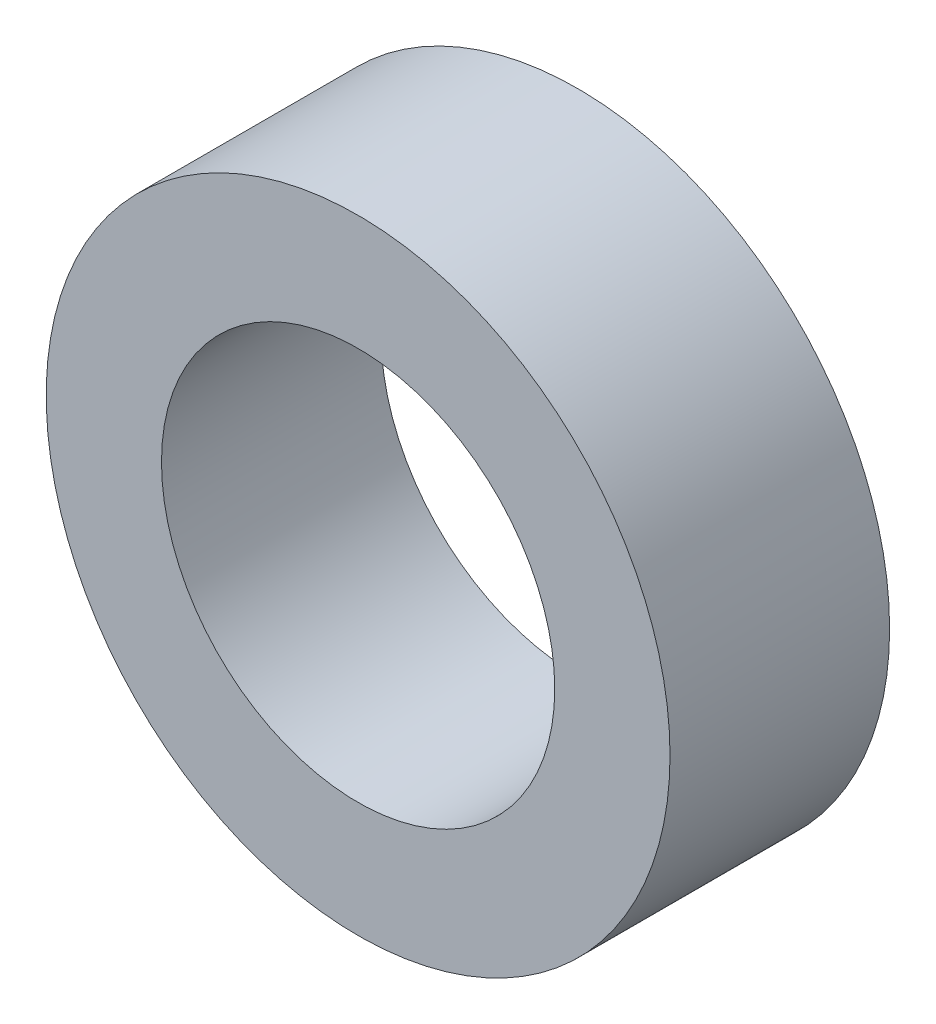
ISO-10303-21;
HEADER;
FILE_DESCRIPTION(('STEP AP214'),'2;1');
FILE_NAME('part.step','',(''),(''),'','','');
FILE_SCHEMA(('AUTOMOTIVE_DESIGN { 1 0 10303 214 1 1 1 1 }'));
ENDSEC;
DATA;
#1=APPLICATION_CONTEXT('core data for automotive mechanical design processes');
#2=APPLICATION_PROTOCOL_DEFINITION('international standard','automotive_design',2000,#1);
#3=PRODUCT_CONTEXT('',#1,'mechanical');
#4=PRODUCT('Part','Part','',(#3));
#5=PRODUCT_RELATED_PRODUCT_CATEGORY('part','',(#4));
#6=PRODUCT_DEFINITION_FORMATION('','',#4);
#7=PRODUCT_DEFINITION_CONTEXT('part definition',#1,'design');
#8=PRODUCT_DEFINITION('design','',#6,#7);
#9=PRODUCT_DEFINITION_SHAPE('','',#8);
#10=(LENGTH_UNIT() NAMED_UNIT(*) SI_UNIT(.MILLI.,.METRE.));
#11=(NAMED_UNIT(*) PLANE_ANGLE_UNIT() SI_UNIT($,.RADIAN.));
#12=(NAMED_UNIT(*) SI_UNIT($,.STERADIAN.) SOLID_ANGLE_UNIT());
#13=UNCERTAINTY_MEASURE_WITH_UNIT(LENGTH_MEASURE(1.E-05),#10,'distance_accuracy_value','');
#14=(GEOMETRIC_REPRESENTATION_CONTEXT(3) GLOBAL_UNCERTAINTY_ASSIGNED_CONTEXT((#13)) GLOBAL_UNIT_ASSIGNED_CONTEXT((#10,
#11,#12)) REPRESENTATION_CONTEXT('',''));
#15=CARTESIAN_POINT('',(0.,0.,0.));
#16=DIRECTION('',(0.,0.,1.));
#17=DIRECTION('',(1.,0.,0.));
#18=AXIS2_PLACEMENT_3D('',#15,#16,#17);
#19=CARTESIAN_POINT('',(0.,0.,5.588));
#20=DIRECTION('',(0.,0.,1.));
#21=DIRECTION('',(1.,0.,0.));
#22=AXIS2_PLACEMENT_3D('',#19,#20,#21);
#23=PLANE('',#22);
#24=CARTESIAN_POINT('',(0.,0.,5.588));
#25=DIRECTION('',(0.,0.,1.));
#26=DIRECTION('',(1.,0.,0.));
#27=AXIS2_PLACEMENT_3D('',#24,#25,#26);
#28=CIRCLE('',#27,7.9375);
#29=CARTESIAN_POINT('',(7.9375,0.,5.588));
#30=VERTEX_POINT('',#29);
#31=EDGE_CURVE('E10',#30,#30,#28,.T.);
#32=ORIENTED_EDGE('',*,*,#31,.T.);
#33=EDGE_LOOP('',(#32));
#34=FACE_BOUND('',#33,.T.);
#35=CARTESIAN_POINT('',(0.,0.,5.588));
#36=DIRECTION('',(0.,0.,1.));
#37=DIRECTION('',(1.,0.,0.));
#38=AXIS2_PLACEMENT_3D('',#35,#36,#37);
#39=CIRCLE('',#38,5.0038);
#40=CARTESIAN_POINT('',(5.0038,0.,5.588));
#41=VERTEX_POINT('',#40);
#42=EDGE_CURVE('E42',#41,#41,#39,.T.);
#43=ORIENTED_EDGE('',*,*,#42,.F.);
#44=EDGE_LOOP('',(#43));
#45=FACE_BOUND('',#44,.T.);
#46=ADVANCED_FACE('F31',(#34,#45),#23,.T.);
#47=CARTESIAN_POINT('',(0.,0.,0.));
#48=DIRECTION('',(0.,0.,1.));
#49=DIRECTION('',(1.,0.,0.));
#50=AXIS2_PLACEMENT_3D('',#47,#48,#49);
#51=PLANE('',#50);
#52=CARTESIAN_POINT('',(0.,0.,0.));
#53=DIRECTION('',(0.,0.,1.));
#54=DIRECTION('',(1.,0.,0.));
#55=AXIS2_PLACEMENT_3D('',#52,#53,#54);
#56=CIRCLE('',#55,7.9375);
#57=CARTESIAN_POINT('',(7.9375,0.,0.));
#58=VERTEX_POINT('',#57);
#59=EDGE_CURVE('E35',#58,#58,#56,.T.);
#60=ORIENTED_EDGE('',*,*,#59,.F.);
#61=EDGE_LOOP('',(#60));
#62=FACE_BOUND('',#61,.T.);
#63=CARTESIAN_POINT('',(0.,0.,0.));
#64=DIRECTION('',(0.,0.,1.));
#65=DIRECTION('',(1.,0.,0.));
#66=AXIS2_PLACEMENT_3D('',#63,#64,#65);
#67=CIRCLE('',#66,5.0038);
#68=CARTESIAN_POINT('',(5.0038,0.,0.));
#69=VERTEX_POINT('',#68);
#70=EDGE_CURVE('E44',#69,#69,#67,.T.);
#71=ORIENTED_EDGE('',*,*,#70,.T.);
#72=EDGE_LOOP('',(#71));
#73=FACE_BOUND('',#72,.T.);
#74=ADVANCED_FACE('F54',(#62,#73),#51,.F.);
#75=CARTESIAN_POINT('',(0.,0.,5.588));
#76=DIRECTION('',(0.,0.,-1.));
#77=DIRECTION('',(-1.,0.,0.));
#78=AXIS2_PLACEMENT_3D('',#75,#76,#77);
#79=CYLINDRICAL_SURFACE('',#78,7.9375);
#80=ORIENTED_EDGE('',*,*,#31,.F.);
#81=EDGE_LOOP('',(#80));
#82=FACE_BOUND('',#81,.T.);
#83=ORIENTED_EDGE('',*,*,#59,.T.);
#84=EDGE_LOOP('',(#83));
#85=FACE_BOUND('',#84,.T.);
#86=ADVANCED_FACE('F33',(#82,#85),#79,.T.);
#87=CARTESIAN_POINT('',(0.,0.,5.588));
#88=DIRECTION('',(0.,0.,-1.));
#89=DIRECTION('',(-1.,0.,0.));
#90=AXIS2_PLACEMENT_3D('',#87,#88,#89);
#91=CYLINDRICAL_SURFACE('',#90,5.0038);
#92=ORIENTED_EDGE('',*,*,#42,.T.);
#93=EDGE_LOOP('',(#92));
#94=FACE_BOUND('',#93,.T.);
#95=ORIENTED_EDGE('',*,*,#70,.F.);
#96=EDGE_LOOP('',(#95));
#97=FACE_BOUND('',#96,.T.);
#98=ADVANCED_FACE('F50',(#94,#97),#91,.F.);
#99=CLOSED_SHELL('',(#46,#74,#86,#98));
#100=MANIFOLD_SOLID_BREP('B2',#99);
#101=ADVANCED_BREP_SHAPE_REPRESENTATION('',(#18,#100),#14);
#102=SHAPE_DEFINITION_REPRESENTATION(#9,#101);
ENDSEC;
END-ISO-10303-21;
